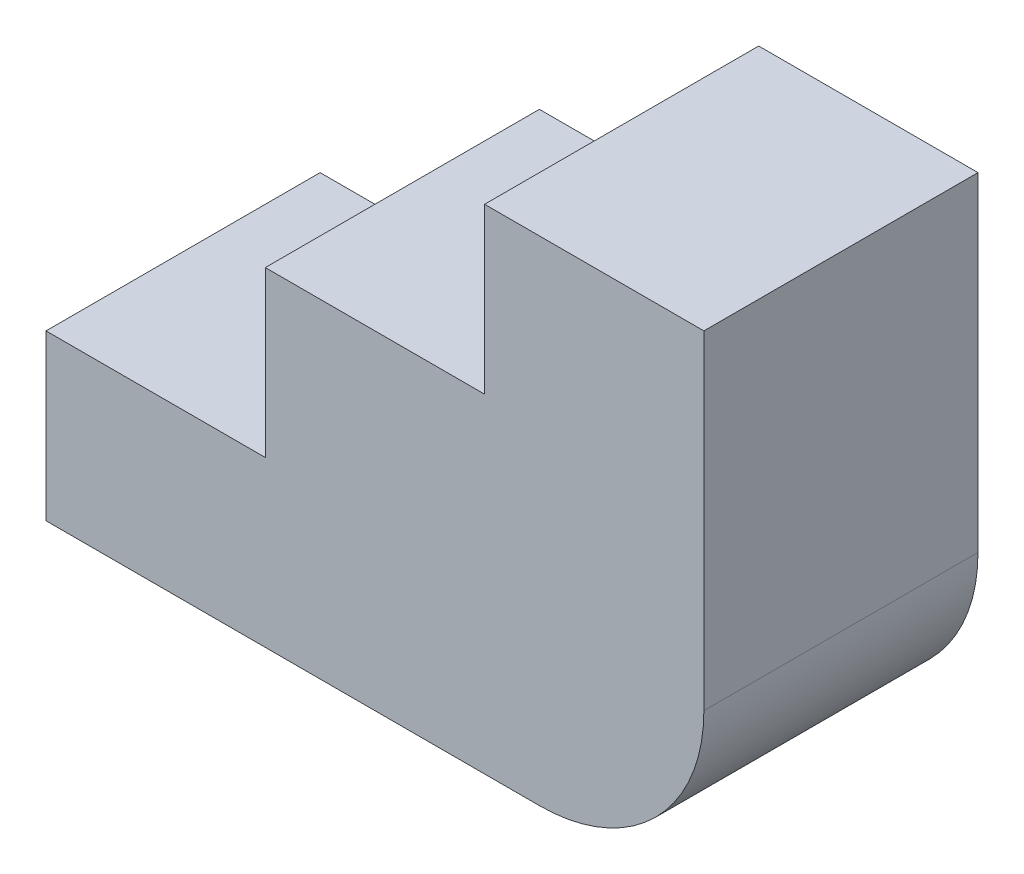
from build123d import *

# Parameters (mm, degrees)
RESSALTO_EXTRUS_O1_DEPTH = 25


with BuildPart() as part:
    # Esbo_o1 → Ressalto-extrus_o1 (new body)
    with BuildSketch(Plane.XY):
        with BuildLine():
            Line((0, 0), (0, -15))
            Line((0, -15), (45, -15))
            ThreePointArc((45, -15), (55.606601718, -10.606601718), (60, 0))
            Line((60, 0), (60, 30))
            Line((60, 30), (40, 30))
            Line((40, 30), (40, 15))
            Line((40, 15), (20, 15))
            Line((20, 15), (20, 0))
            Line((20, 0), (0, 0))
        make_face()
    extrude(amount=RESSALTO_EXTRUS_O1_DEPTH)


solid = part.part
